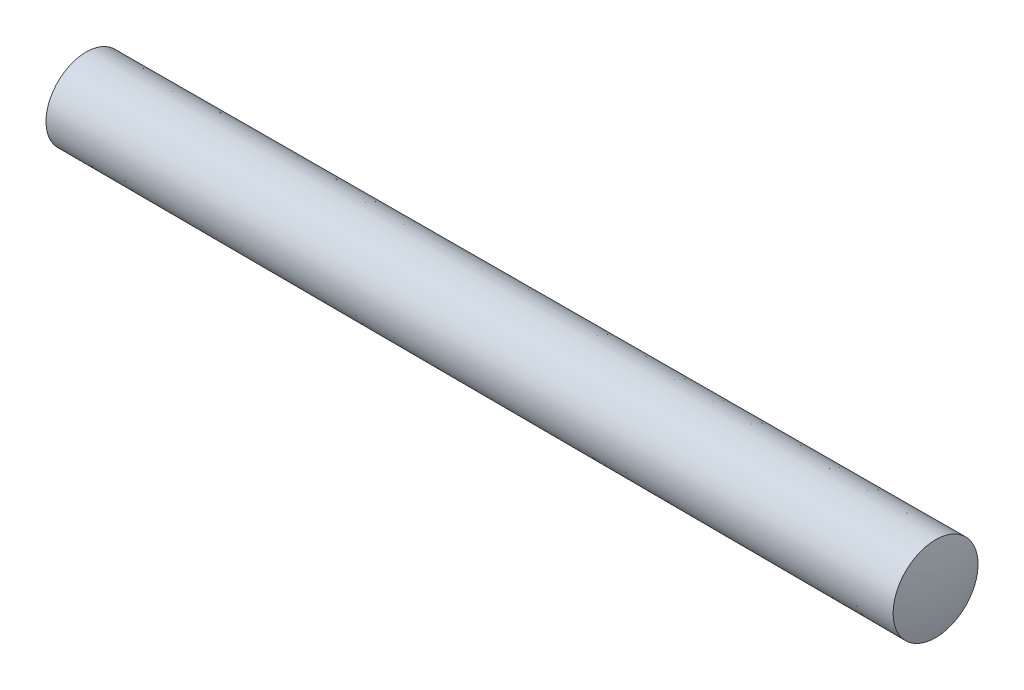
from build123d import *


with BuildPart() as part:
    # BodySke → BaseBody (revolve)
    with BuildSketch(Plane.XY):
        with BuildLine():
            Line((-0.361762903, 0), (63.903277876, 0))
            ThreePointArc((63.903277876, 0), (63.802055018, 1.600254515), (63.5, 3.175))
            Line((63.5, 3.175), (0, 3.009635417))
            ThreePointArc((0, 3.009635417), (-0.270997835, 1.515649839), (-0.361762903, 0))
        make_face()
    revolve(axis=Axis((-103.417362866, 0, 0), (1, 0, 0)))


solid = part.part
